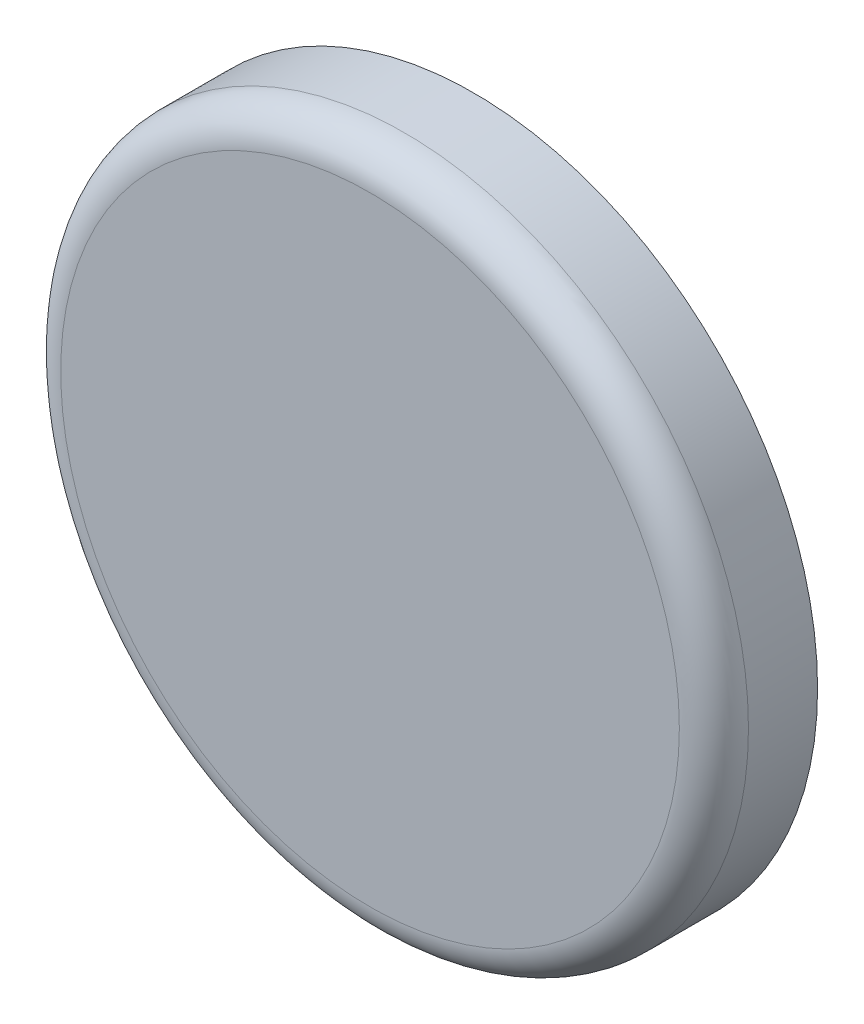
ISO-10303-21;
HEADER;
FILE_DESCRIPTION(('STEP AP214'),'2;1');
FILE_NAME('part.step','',(''),(''),'','','');
FILE_SCHEMA(('AUTOMOTIVE_DESIGN { 1 0 10303 214 1 1 1 1 }'));
ENDSEC;
DATA;
#1=APPLICATION_CONTEXT('core data for automotive mechanical design processes');
#2=APPLICATION_PROTOCOL_DEFINITION('international standard','automotive_design',2000,#1);
#3=PRODUCT_CONTEXT('',#1,'mechanical');
#4=PRODUCT('Part','Part','',(#3));
#5=PRODUCT_RELATED_PRODUCT_CATEGORY('part','',(#4));
#6=PRODUCT_DEFINITION_FORMATION('','',#4);
#7=PRODUCT_DEFINITION_CONTEXT('part definition',#1,'design');
#8=PRODUCT_DEFINITION('design','',#6,#7);
#9=PRODUCT_DEFINITION_SHAPE('','',#8);
#10=(LENGTH_UNIT() NAMED_UNIT(*) SI_UNIT(.MILLI.,.METRE.));
#11=(NAMED_UNIT(*) PLANE_ANGLE_UNIT() SI_UNIT($,.RADIAN.));
#12=(NAMED_UNIT(*) SI_UNIT($,.STERADIAN.) SOLID_ANGLE_UNIT());
#13=UNCERTAINTY_MEASURE_WITH_UNIT(LENGTH_MEASURE(1.E-05),#10,'distance_accuracy_value','');
#14=(GEOMETRIC_REPRESENTATION_CONTEXT(3) GLOBAL_UNCERTAINTY_ASSIGNED_CONTEXT((#13)) GLOBAL_UNIT_ASSIGNED_CONTEXT((#10,
#11,#12)) REPRESENTATION_CONTEXT('',''));
#15=CARTESIAN_POINT('',(0.,0.,0.));
#16=DIRECTION('',(0.,0.,1.));
#17=DIRECTION('',(1.,0.,0.));
#18=AXIS2_PLACEMENT_3D('',#15,#16,#17);
#19=CARTESIAN_POINT('',(0.,0.,3.));
#20=DIRECTION('',(0.,0.,-1.));
#21=DIRECTION('',(-1.,0.,0.));
#22=AXIS2_PLACEMENT_3D('',#19,#20,#21);
#23=CYLINDRICAL_SURFACE('',#22,9.95);
#24=CARTESIAN_POINT('',(0.,0.,2.));
#25=DIRECTION('',(0.,0.,1.));
#26=DIRECTION('',(1.,0.,0.));
#27=AXIS2_PLACEMENT_3D('',#24,#25,#26);
#28=CIRCLE('',#27,9.95);
#29=CARTESIAN_POINT('',(9.95,0.,2.));
#30=VERTEX_POINT('',#29);
#31=EDGE_CURVE('E10',#30,#30,#28,.F.);
#32=ORIENTED_EDGE('',*,*,#31,.T.);
#33=EDGE_LOOP('',(#32));
#34=FACE_BOUND('',#33,.T.);
#35=CARTESIAN_POINT('',(0.,0.,0.));
#36=DIRECTION('',(0.,0.,1.));
#37=DIRECTION('',(1.,0.,0.));
#38=AXIS2_PLACEMENT_3D('',#35,#36,#37);
#39=CIRCLE('',#38,9.95);
#40=CARTESIAN_POINT('',(9.95,0.,0.));
#41=VERTEX_POINT('',#40);
#42=EDGE_CURVE('E47',#41,#41,#39,.T.);
#43=ORIENTED_EDGE('',*,*,#42,.T.);
#44=EDGE_LOOP('',(#43));
#45=FACE_BOUND('',#44,.T.);
#46=ADVANCED_FACE('F34',(#34,#45),#23,.T.);
#47=CARTESIAN_POINT('',(0.,0.,3.));
#48=DIRECTION('',(0.,0.,1.));
#49=DIRECTION('',(1.,0.,0.));
#50=AXIS2_PLACEMENT_3D('',#47,#48,#49);
#51=PLANE('',#50);
#52=CARTESIAN_POINT('',(0.,0.,3.));
#53=DIRECTION('',(0.,0.,1.));
#54=DIRECTION('',(1.,0.,0.));
#55=AXIS2_PLACEMENT_3D('',#52,#53,#54);
#56=CIRCLE('',#55,8.95);
#57=CARTESIAN_POINT('',(8.95,0.,3.));
#58=VERTEX_POINT('',#57);
#59=EDGE_CURVE('E42',#58,#58,#56,.T.);
#60=ORIENTED_EDGE('',*,*,#59,.T.);
#61=EDGE_LOOP('',(#60));
#62=FACE_BOUND('',#61,.T.);
#63=ADVANCED_FACE('F58',(#62),#51,.T.);
#64=CARTESIAN_POINT('',(0.,0.,0.));
#65=DIRECTION('',(0.,0.,1.));
#66=DIRECTION('',(1.,0.,0.));
#67=AXIS2_PLACEMENT_3D('',#64,#65,#66);
#68=PLANE('',#67);
#69=ORIENTED_EDGE('',*,*,#42,.F.);
#70=EDGE_LOOP('',(#69));
#71=FACE_BOUND('',#70,.T.);
#72=ADVANCED_FACE('F56',(#71),#68,.F.);
#73=CARTESIAN_POINT('',(0.,0.,2.));
#74=DIRECTION('',(0.,0.,1.));
#75=DIRECTION('',(1.,0.,0.));
#76=AXIS2_PLACEMENT_3D('',#73,#74,#75);
#77=TOROIDAL_SURFACE('',#76,8.95,1.);
#78=ORIENTED_EDGE('',*,*,#31,.F.);
#79=EDGE_LOOP('',(#78));
#80=FACE_BOUND('',#79,.T.);
#81=ORIENTED_EDGE('',*,*,#59,.F.);
#82=EDGE_LOOP('',(#81));
#83=FACE_BOUND('',#82,.T.);
#84=ADVANCED_FACE('F36',(#80,#83),#77,.T.);
#85=CLOSED_SHELL('',(#46,#63,#72,#84));
#86=MANIFOLD_SOLID_BREP('B2',#85);
#87=ADVANCED_BREP_SHAPE_REPRESENTATION('',(#18,#86),#14);
#88=SHAPE_DEFINITION_REPRESENTATION(#9,#87);
ENDSEC;
END-ISO-10303-21;
